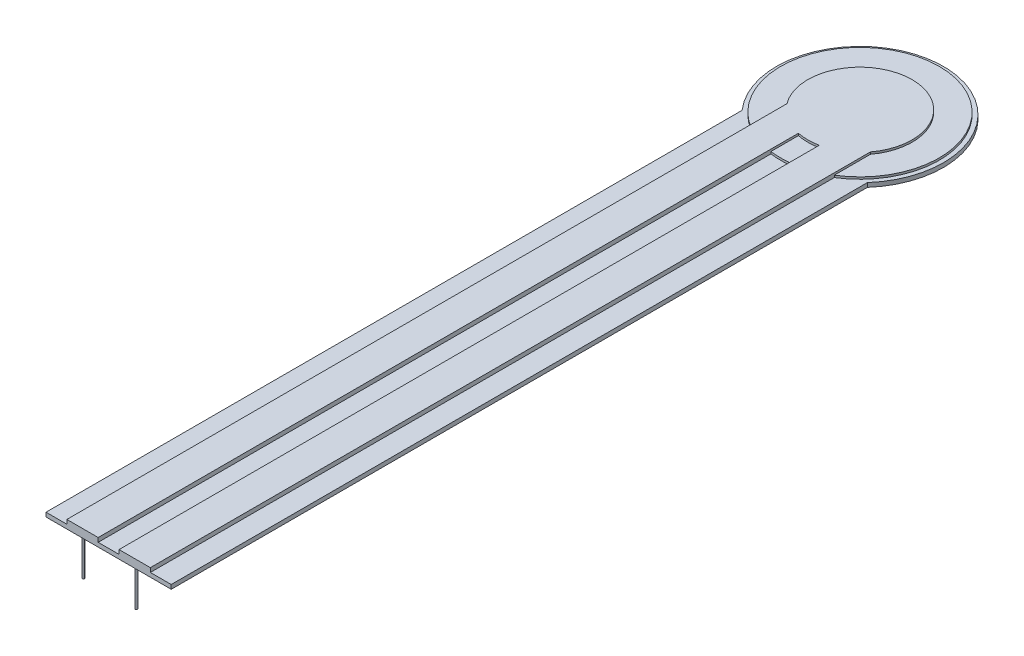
from build123d import *

# Parameters (mm, degrees)
EXTRUSION1_DEPTH = 0.2
ESQUISSE2_R      = 3.8
EXTRUSION2_DEPTH = 0.1
EXTRUSION3_DEPTH = 0.2
ESQUISSE4_R      = 0.05
EXTRUSION4_DEPTH = 1.7


with BuildPart() as part:
    # Esquisse1 → Extrusion1 (new body)
    with BuildSketch(Plane(origin=(0, 0, 0), x_dir=(1, 0, 0), z_dir=(0, 1, 0))):
        with BuildLine():
            Line((-3, 0), (3, 0))
            Line((3, 0), (3, 33.354248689))
            ThreePointArc((3, 33.354248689), (0, 40), (-3, 33.354248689))
            Line((-3, 33.354248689), (-3, 0))
        make_face()
    extrude(amount=EXTRUSION1_DEPTH)

    # Esquisse2 → Extrusion2 (add)
    with BuildSketch(Plane(origin=(0, 0.2, 0), x_dir=(-1, 0, 0), z_dir=(0, 1, 0))):
        with Locations(Location((0, -36, 0), (0, 0, 90))):
            Circle(ESQUISSE2_R)
    extrude(amount=EXTRUSION2_DEPTH)

    # Esquisse3 → Extrusion3 (add)
    with BuildSketch(Plane(origin=(0, 0.2, 0), x_dir=(-1, 0, 0), z_dir=(0, 1, 0))):
        with BuildLine():
            Line((-2, 0), (-0.5, 0))
            Line((-0.5, 0), (-0.5, -33.550510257))
            ThreePointArc((-0.5, -33.550510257), (0, -33.5), (0.5, -33.550510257))
            Line((0.5, -33.550510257), (0.5, 0))
            Line((0.5, 0), (2, 0))
            Line((2, 0), (2, -34.5))
            ThreePointArc((2, -34.5), (0, -38.5), (-2, -34.5))
            Line((-2, -34.5), (-2, 0))
        make_face()
    extrude(amount=EXTRUSION3_DEPTH)

    # Esquisse4 → Extrusion4 (add)
    with BuildSketch(Plane.XZ):
        with Locations(Location((1.27, -0.057768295, 0), (0, 0, 90))):
            Circle(ESQUISSE4_R)
        with Locations(Location((-1.27, -0.057768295, 0), (0, 0, 90))):
            Circle(ESQUISSE4_R)
    extrude(amount=EXTRUSION4_DEPTH)


solid = part.part
